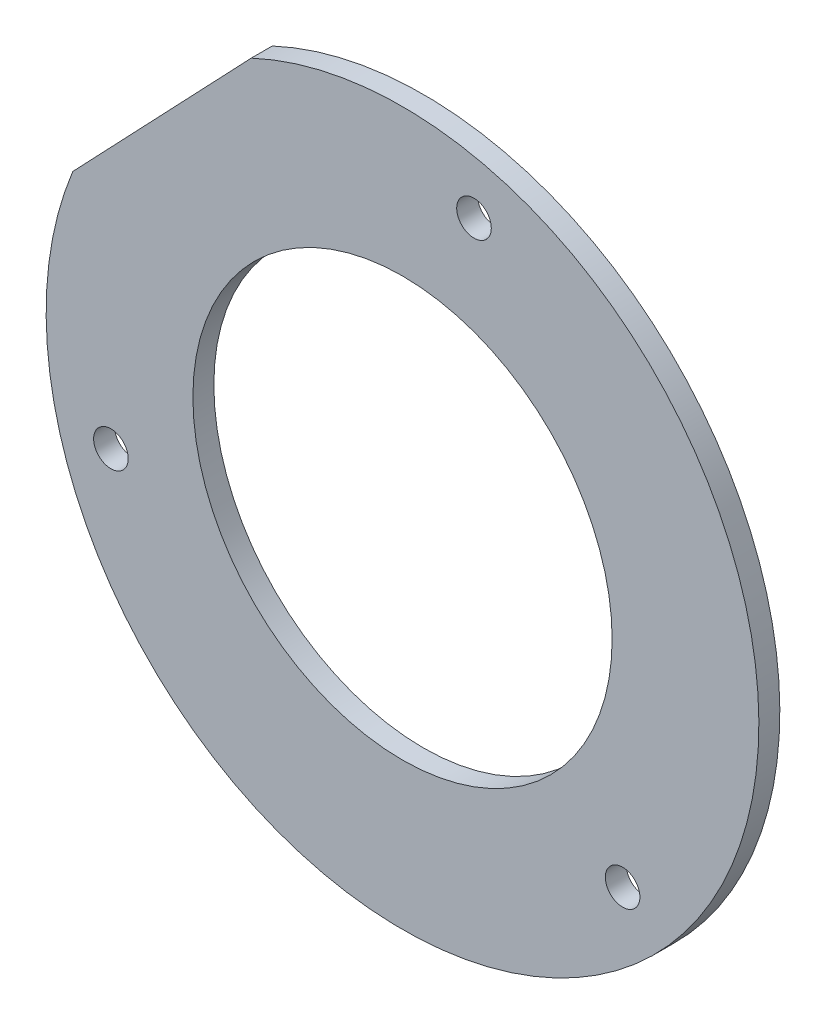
ISO-10303-21;
HEADER;
FILE_DESCRIPTION(('STEP AP214'),'2;1');
FILE_NAME('part.step','',(''),(''),'','','');
FILE_SCHEMA(('AUTOMOTIVE_DESIGN { 1 0 10303 214 1 1 1 1 }'));
ENDSEC;
DATA;
#1=APPLICATION_CONTEXT('core data for automotive mechanical design processes');
#2=APPLICATION_PROTOCOL_DEFINITION('international standard','automotive_design',2000,#1);
#3=PRODUCT_CONTEXT('',#1,'mechanical');
#4=PRODUCT('Part','Part','',(#3));
#5=PRODUCT_RELATED_PRODUCT_CATEGORY('part','',(#4));
#6=PRODUCT_DEFINITION_FORMATION('','',#4);
#7=PRODUCT_DEFINITION_CONTEXT('part definition',#1,'design');
#8=PRODUCT_DEFINITION('design','',#6,#7);
#9=PRODUCT_DEFINITION_SHAPE('','',#8);
#10=(LENGTH_UNIT() NAMED_UNIT(*) SI_UNIT(.MILLI.,.METRE.));
#11=(NAMED_UNIT(*) PLANE_ANGLE_UNIT() SI_UNIT($,.RADIAN.));
#12=(NAMED_UNIT(*) SI_UNIT($,.STERADIAN.) SOLID_ANGLE_UNIT());
#13=UNCERTAINTY_MEASURE_WITH_UNIT(LENGTH_MEASURE(1.E-05),#10,'distance_accuracy_value','');
#14=(GEOMETRIC_REPRESENTATION_CONTEXT(3) GLOBAL_UNCERTAINTY_ASSIGNED_CONTEXT((#13)) GLOBAL_UNIT_ASSIGNED_CONTEXT((#10,
#11,#12)) REPRESENTATION_CONTEXT('',''));
#15=CARTESIAN_POINT('',(0.,0.,0.));
#16=DIRECTION('',(0.,0.,1.));
#17=DIRECTION('',(1.,0.,0.));
#18=AXIS2_PLACEMENT_3D('',#15,#16,#17);
#19=CARTESIAN_POINT('',(17.,52.,2.));
#20=DIRECTION('',(0.,0.,1.));
#21=DIRECTION('',(1.,0.,0.));
#22=AXIS2_PLACEMENT_3D('',#19,#20,#21);
#23=PLANE('',#22);
#24=CARTESIAN_POINT('',(23.820508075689,80.1865334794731,2.));
#25=DIRECTION('',(0.,0.,1.));
#26=DIRECTION('',(1.,0.,0.));
#27=AXIS2_PLACEMENT_3D('',#24,#25,#26);
#28=CIRCLE('',#27,1.64999999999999);
#29=CARTESIAN_POINT('',(25.470508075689,80.1865334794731,2.));
#30=VERTEX_POINT('',#29);
#31=EDGE_CURVE('E93',#30,#30,#28,.T.);
#32=ORIENTED_EDGE('',*,*,#31,.F.);
#33=EDGE_LOOP('',(#32));
#34=FACE_BOUND('',#33,.T.);
#35=CARTESIAN_POINT('',(-10.8205080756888,43.8134665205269,2.));
#36=DIRECTION('',(0.,0.,1.));
#37=DIRECTION('',(1.,0.,0.));
#38=AXIS2_PLACEMENT_3D('',#35,#36,#37);
#39=CIRCLE('',#38,1.64999999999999);
#40=CARTESIAN_POINT('',(-9.17050807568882,43.8134665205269,2.));
#41=VERTEX_POINT('',#40);
#42=EDGE_CURVE('E87',#41,#41,#39,.T.);
#43=ORIENTED_EDGE('',*,*,#42,.F.);
#44=EDGE_LOOP('',(#43));
#45=FACE_BOUND('',#44,.T.);
#46=CARTESIAN_POINT('',(38.,32.,2.));
#47=DIRECTION('',(0.,0.,1.));
#48=DIRECTION('',(1.,0.,0.));
#49=AXIS2_PLACEMENT_3D('',#46,#47,#48);
#50=CIRCLE('',#49,1.64999999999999);
#51=CARTESIAN_POINT('',(39.65,32.,2.));
#52=VERTEX_POINT('',#51);
#53=EDGE_CURVE('E81',#52,#52,#50,.T.);
#54=ORIENTED_EDGE('',*,*,#53,.F.);
#55=EDGE_LOOP('',(#54));
#56=FACE_BOUND('',#55,.T.);
#57=CARTESIAN_POINT('',(17.,52.,2.));
#58=DIRECTION('',(0.,0.,1.));
#59=DIRECTION('',(1.,0.,0.));
#60=AXIS2_PLACEMENT_3D('',#57,#58,#59);
#61=CIRCLE('',#60,34.);
#62=CARTESIAN_POINT('',(-14.4528021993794,64.9120576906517,2.));
#63=VERTEX_POINT('',#62);
#64=CARTESIAN_POINT('',(2.56992467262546,82.7859209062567,2.));
#65=VERTEX_POINT('',#64);
#66=EDGE_CURVE('E62',#63,#65,#61,.T.);
#67=ORIENTED_EDGE('',*,*,#66,.T.);
#68=DIRECTION('',(-0.689655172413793,-0.724137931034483,0.));
#69=VECTOR('',#68,1.);
#70=CARTESIAN_POINT('',(2.56992467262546,82.7859209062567,2.));
#71=LINE('',#70,#69);
#72=EDGE_CURVE('E47',#65,#63,#71,.T.);
#73=ORIENTED_EDGE('',*,*,#72,.T.);
#74=EDGE_LOOP('',(#67,#73));
#75=FACE_BOUND('',#74,.T.);
#76=CARTESIAN_POINT('',(17.,52.,2.));
#77=DIRECTION('',(0.,0.,1.));
#78=DIRECTION('',(1.,0.,0.));
#79=AXIS2_PLACEMENT_3D('',#76,#77,#78);
#80=CIRCLE('',#79,20.);
#81=CARTESIAN_POINT('',(37.,52.,2.));
#82=VERTEX_POINT('',#81);
#83=EDGE_CURVE('E68',#82,#82,#80,.T.);
#84=ORIENTED_EDGE('',*,*,#83,.F.);
#85=EDGE_LOOP('',(#84));
#86=FACE_BOUND('',#85,.T.);
#87=ADVANCED_FACE('F31',(#34,#45,#56,#75,#86),#23,.T.);
#88=CARTESIAN_POINT('',(17.,52.,0.));
#89=DIRECTION('',(0.,0.,1.));
#90=DIRECTION('',(1.,0.,0.));
#91=AXIS2_PLACEMENT_3D('',#88,#89,#90);
#92=PLANE('',#91);
#93=CARTESIAN_POINT('',(23.820508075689,80.1865334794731,0.));
#94=DIRECTION('',(0.,0.,1.));
#95=DIRECTION('',(1.,0.,0.));
#96=AXIS2_PLACEMENT_3D('',#93,#94,#95);
#97=CIRCLE('',#96,1.65);
#98=CARTESIAN_POINT('',(25.470508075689,80.1865334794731,0.));
#99=VERTEX_POINT('',#98);
#100=EDGE_CURVE('E90',#99,#99,#97,.T.);
#101=ORIENTED_EDGE('',*,*,#100,.T.);
#102=EDGE_LOOP('',(#101));
#103=FACE_BOUND('',#102,.T.);
#104=CARTESIAN_POINT('',(-10.8205080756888,43.8134665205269,0.));
#105=DIRECTION('',(0.,0.,1.));
#106=DIRECTION('',(1.,0.,0.));
#107=AXIS2_PLACEMENT_3D('',#104,#105,#106);
#108=CIRCLE('',#107,1.65);
#109=CARTESIAN_POINT('',(-9.17050807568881,43.8134665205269,0.));
#110=VERTEX_POINT('',#109);
#111=EDGE_CURVE('E84',#110,#110,#108,.T.);
#112=ORIENTED_EDGE('',*,*,#111,.T.);
#113=EDGE_LOOP('',(#112));
#114=FACE_BOUND('',#113,.T.);
#115=CARTESIAN_POINT('',(38.,32.,0.));
#116=DIRECTION('',(0.,0.,1.));
#117=DIRECTION('',(1.,0.,0.));
#118=AXIS2_PLACEMENT_3D('',#115,#116,#117);
#119=CIRCLE('',#118,1.65);
#120=CARTESIAN_POINT('',(39.65,32.,0.));
#121=VERTEX_POINT('',#120);
#122=EDGE_CURVE('E77',#121,#121,#119,.T.);
#123=ORIENTED_EDGE('',*,*,#122,.T.);
#124=EDGE_LOOP('',(#123));
#125=FACE_BOUND('',#124,.T.);
#126=CARTESIAN_POINT('',(17.,52.,0.));
#127=DIRECTION('',(0.,0.,1.));
#128=DIRECTION('',(1.,0.,0.));
#129=AXIS2_PLACEMENT_3D('',#126,#127,#128);
#130=CIRCLE('',#129,34.);
#131=CARTESIAN_POINT('',(-14.4528021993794,64.9120576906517,0.));
#132=VERTEX_POINT('',#131);
#133=CARTESIAN_POINT('',(2.56992467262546,82.7859209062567,0.));
#134=VERTEX_POINT('',#133);
#135=EDGE_CURVE('E63',#132,#134,#130,.T.);
#136=ORIENTED_EDGE('',*,*,#135,.F.);
#137=DIRECTION('',(-0.689655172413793,-0.724137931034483,0.));
#138=VECTOR('',#137,1.);
#139=CARTESIAN_POINT('',(2.56992467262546,82.7859209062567,0.));
#140=LINE('',#139,#138);
#141=EDGE_CURVE('E55',#134,#132,#140,.T.);
#142=ORIENTED_EDGE('',*,*,#141,.F.);
#143=EDGE_LOOP('',(#136,#142));
#144=FACE_BOUND('',#143,.T.);
#145=CARTESIAN_POINT('',(17.,52.,0.));
#146=DIRECTION('',(0.,0.,1.));
#147=DIRECTION('',(1.,0.,0.));
#148=AXIS2_PLACEMENT_3D('',#145,#146,#147);
#149=CIRCLE('',#148,20.);
#150=CARTESIAN_POINT('',(37.,52.,0.));
#151=VERTEX_POINT('',#150);
#152=EDGE_CURVE('E71',#151,#151,#149,.T.);
#153=ORIENTED_EDGE('',*,*,#152,.T.);
#154=EDGE_LOOP('',(#153));
#155=FACE_BOUND('',#154,.T.);
#156=ADVANCED_FACE('F66',(#103,#114,#125,#144,#155),#92,.F.);
#157=CARTESIAN_POINT('',(17.,52.,2.));
#158=DIRECTION('',(0.,0.,-1.));
#159=DIRECTION('',(-1.,0.,0.));
#160=AXIS2_PLACEMENT_3D('',#157,#158,#159);
#161=CYLINDRICAL_SURFACE('',#160,34.);
#162=ORIENTED_EDGE('',*,*,#135,.T.);
#163=DIRECTION('',(0.,0.,-1.));
#164=VECTOR('',#163,1.);
#165=CARTESIAN_POINT('',(2.56992467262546,82.7859209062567,2.));
#166=LINE('',#165,#164);
#167=EDGE_CURVE('E11',#65,#134,#166,.T.);
#168=ORIENTED_EDGE('',*,*,#167,.F.);
#169=ORIENTED_EDGE('',*,*,#66,.F.);
#170=DIRECTION('',(0.,0.,-1.));
#171=VECTOR('',#170,1.);
#172=CARTESIAN_POINT('',(-14.4528021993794,64.9120576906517,2.));
#173=LINE('',#172,#171);
#174=EDGE_CURVE('E40',#63,#132,#173,.T.);
#175=ORIENTED_EDGE('',*,*,#174,.T.);
#176=EDGE_LOOP('',(#162,#168,#169,#175));
#177=FACE_BOUND('',#176,.T.);
#178=ADVANCED_FACE('F33',(#177),#161,.T.);
#179=CARTESIAN_POINT('',(2.56992467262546,82.7859209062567,2.));
#180=DIRECTION('',(0.724137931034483,-0.689655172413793,0.));
#181=DIRECTION('',(0.689655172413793,0.724137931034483,0.));
#182=AXIS2_PLACEMENT_3D('',#179,#180,#181);
#183=PLANE('',#182);
#184=ORIENTED_EDGE('',*,*,#141,.T.);
#185=ORIENTED_EDGE('',*,*,#174,.F.);
#186=ORIENTED_EDGE('',*,*,#72,.F.);
#187=ORIENTED_EDGE('',*,*,#167,.T.);
#188=EDGE_LOOP('',(#184,#185,#186,#187));
#189=FACE_BOUND('',#188,.T.);
#190=ADVANCED_FACE('F58',(#189),#183,.F.);
#191=CARTESIAN_POINT('',(17.,52.,2.));
#192=DIRECTION('',(0.,0.,-1.));
#193=DIRECTION('',(-1.,0.,0.));
#194=AXIS2_PLACEMENT_3D('',#191,#192,#193);
#195=CYLINDRICAL_SURFACE('',#194,20.);
#196=ORIENTED_EDGE('',*,*,#83,.T.);
#197=EDGE_LOOP('',(#196));
#198=FACE_BOUND('',#197,.T.);
#199=ORIENTED_EDGE('',*,*,#152,.F.);
#200=EDGE_LOOP('',(#199));
#201=FACE_BOUND('',#200,.T.);
#202=ADVANCED_FACE('F108',(#198,#201),#195,.F.);
#203=CARTESIAN_POINT('',(38.,32.,2.));
#204=DIRECTION('',(0.,0.,1.));
#205=DIRECTION('',(1.,0.,0.));
#206=AXIS2_PLACEMENT_3D('',#203,#204,#205);
#207=CYLINDRICAL_SURFACE('',#206,1.65);
#208=ORIENTED_EDGE('',*,*,#122,.F.);
#209=EDGE_LOOP('',(#208));
#210=FACE_BOUND('',#209,.T.);
#211=ORIENTED_EDGE('',*,*,#53,.T.);
#212=EDGE_LOOP('',(#211));
#213=FACE_BOUND('',#212,.T.);
#214=ADVANCED_FACE('F111',(#210,#213),#207,.F.);
#215=CARTESIAN_POINT('',(-10.8205080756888,43.8134665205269,2.));
#216=DIRECTION('',(0.,0.,1.));
#217=DIRECTION('',(1.,0.,0.));
#218=AXIS2_PLACEMENT_3D('',#215,#216,#217);
#219=CYLINDRICAL_SURFACE('',#218,1.64999999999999);
#220=ORIENTED_EDGE('',*,*,#111,.F.);
#221=EDGE_LOOP('',(#220));
#222=FACE_BOUND('',#221,.T.);
#223=ORIENTED_EDGE('',*,*,#42,.T.);
#224=EDGE_LOOP('',(#223));
#225=FACE_BOUND('',#224,.T.);
#226=ADVANCED_FACE('F137',(#222,#225),#219,.F.);
#227=CARTESIAN_POINT('',(23.820508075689,80.1865334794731,2.));
#228=DIRECTION('',(0.,0.,1.));
#229=DIRECTION('',(1.,0.,0.));
#230=AXIS2_PLACEMENT_3D('',#227,#228,#229);
#231=CYLINDRICAL_SURFACE('',#230,1.64999999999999);
#232=ORIENTED_EDGE('',*,*,#100,.F.);
#233=EDGE_LOOP('',(#232));
#234=FACE_BOUND('',#233,.T.);
#235=ORIENTED_EDGE('',*,*,#31,.T.);
#236=EDGE_LOOP('',(#235));
#237=FACE_BOUND('',#236,.T.);
#238=ADVANCED_FACE('F97',(#234,#237),#231,.F.);
#239=CLOSED_SHELL('',(#87,#156,#178,#190,#202,#214,#226,#238));
#240=MANIFOLD_SOLID_BREP('B2',#239);
#241=ADVANCED_BREP_SHAPE_REPRESENTATION('',(#18,#240),#14);
#242=SHAPE_DEFINITION_REPRESENTATION(#9,#241);
ENDSEC;
END-ISO-10303-21;
